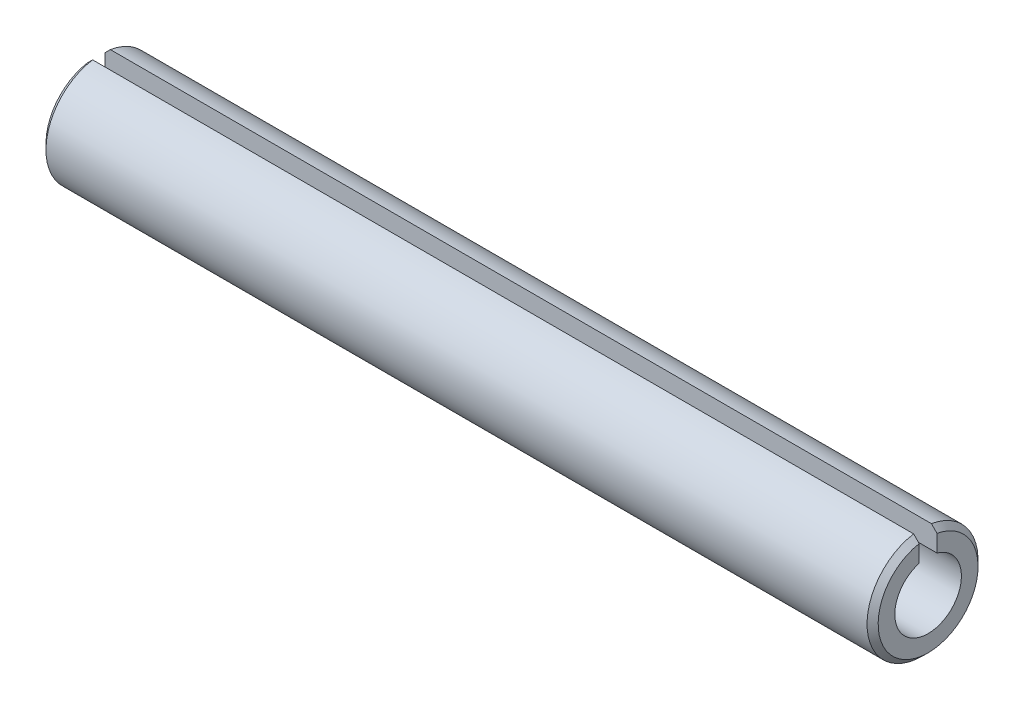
ISO-10303-21;
HEADER;
FILE_DESCRIPTION(('STEP AP214'),'2;1');
FILE_NAME('part.step','',(''),(''),'','','');
FILE_SCHEMA(('AUTOMOTIVE_DESIGN { 1 0 10303 214 1 1 1 1 }'));
ENDSEC;
DATA;
#1=APPLICATION_CONTEXT('core data for automotive mechanical design processes');
#2=APPLICATION_PROTOCOL_DEFINITION('international standard','automotive_design',2000,#1);
#3=PRODUCT_CONTEXT('',#1,'mechanical');
#4=PRODUCT('Part','Part','',(#3));
#5=PRODUCT_RELATED_PRODUCT_CATEGORY('part','',(#4));
#6=PRODUCT_DEFINITION_FORMATION('','',#4);
#7=PRODUCT_DEFINITION_CONTEXT('part definition',#1,'design');
#8=PRODUCT_DEFINITION('design','',#6,#7);
#9=PRODUCT_DEFINITION_SHAPE('','',#8);
#10=(LENGTH_UNIT() NAMED_UNIT(*) SI_UNIT(.MILLI.,.METRE.));
#11=(NAMED_UNIT(*) PLANE_ANGLE_UNIT() SI_UNIT($,.RADIAN.));
#12=(NAMED_UNIT(*) SI_UNIT($,.STERADIAN.) SOLID_ANGLE_UNIT());
#13=UNCERTAINTY_MEASURE_WITH_UNIT(LENGTH_MEASURE(1.E-05),#10,'distance_accuracy_value','');
#14=(GEOMETRIC_REPRESENTATION_CONTEXT(3) GLOBAL_UNCERTAINTY_ASSIGNED_CONTEXT((#13)) GLOBAL_UNIT_ASSIGNED_CONTEXT((#10,
#11,#12)) REPRESENTATION_CONTEXT('',''));
#15=CARTESIAN_POINT('',(0.,0.,0.));
#16=DIRECTION('',(0.,0.,1.));
#17=DIRECTION('',(1.,0.,0.));
#18=AXIS2_PLACEMENT_3D('',#15,#16,#17);
#19=CARTESIAN_POINT('',(0.,0.,0.));
#20=DIRECTION('',(-1.,0.,0.));
#21=DIRECTION('',(0.,0.,1.));
#22=AXIS2_PLACEMENT_3D('',#19,#20,#21);
#23=CYLINDRICAL_SURFACE('',#22,1.2);
#24=DIRECTION('',(-1.,0.,0.));
#25=VECTOR('',#24,1.);
#26=CARTESIAN_POINT('',(30.,1.15654658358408,0.32));
#27=LINE('',#26,#25);
#28=CARTESIAN_POINT('',(30.,1.15654658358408,0.32));
#29=VERTEX_POINT('',#28);
#30=CARTESIAN_POINT('',(0.,1.15654658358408,0.320000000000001));
#31=VERTEX_POINT('',#30);
#32=EDGE_CURVE('E47',#29,#31,#27,.T.);
#33=ORIENTED_EDGE('',*,*,#32,.F.);
#34=CARTESIAN_POINT('',(30.,0.,0.));
#35=DIRECTION('',(-1.,0.,0.));
#36=DIRECTION('',(0.,0.,1.));
#37=AXIS2_PLACEMENT_3D('',#34,#35,#36);
#38=CIRCLE('',#37,1.2);
#39=CARTESIAN_POINT('',(30.,1.15654658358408,-0.32));
#40=VERTEX_POINT('',#39);
#41=EDGE_CURVE('E89',#40,#29,#38,.T.);
#42=ORIENTED_EDGE('',*,*,#41,.F.);
#43=DIRECTION('',(-1.,0.,0.));
#44=VECTOR('',#43,1.);
#45=CARTESIAN_POINT('',(30.,1.15654658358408,-0.32));
#46=LINE('',#45,#44);
#47=CARTESIAN_POINT('',(0.,1.15654658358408,-0.32));
#48=VERTEX_POINT('',#47);
#49=EDGE_CURVE('E83',#40,#48,#46,.T.);
#50=ORIENTED_EDGE('',*,*,#49,.T.);
#51=CARTESIAN_POINT('',(0.,0.,0.));
#52=DIRECTION('',(-1.,0.,0.));
#53=DIRECTION('',(0.,0.,1.));
#54=AXIS2_PLACEMENT_3D('',#51,#52,#53);
#55=CIRCLE('',#54,1.2);
#56=EDGE_CURVE('E93',#48,#31,#55,.T.);
#57=ORIENTED_EDGE('',*,*,#56,.T.);
#58=EDGE_LOOP('',(#33,#42,#50,#57));
#59=FACE_BOUND('',#58,.T.);
#60=ADVANCED_FACE('F33',(#59),#23,.F.);
#61=CARTESIAN_POINT('',(30.,1.2,0.));
#62=DIRECTION('',(-1.,0.,0.));
#63=DIRECTION('',(0.,0.,1.));
#64=AXIS2_PLACEMENT_3D('',#61,#62,#63);
#65=PLANE('',#64);
#66=DIRECTION('',(0.,-1.,0.));
#67=VECTOR('',#66,1.);
#68=CARTESIAN_POINT('',(30.,1.97423402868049,0.32));
#69=LINE('',#68,#67);
#70=CARTESIAN_POINT('',(30.,1.77132718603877,0.32));
#71=VERTEX_POINT('',#70);
#72=EDGE_CURVE('E124',#71,#29,#69,.T.);
#73=ORIENTED_EDGE('',*,*,#72,.F.);
#74=CARTESIAN_POINT('',(30.,0.,0.));
#75=DIRECTION('',(-1.,0.,0.));
#76=DIRECTION('',(0.,0.,1.));
#77=AXIS2_PLACEMENT_3D('',#74,#75,#76);
#78=CIRCLE('',#77,1.8);
#79=CARTESIAN_POINT('',(30.,1.77132718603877,-0.32));
#80=VERTEX_POINT('',#79);
#81=EDGE_CURVE('E117',#80,#71,#78,.T.);
#82=ORIENTED_EDGE('',*,*,#81,.F.);
#83=DIRECTION('',(0.,-1.,0.));
#84=VECTOR('',#83,1.);
#85=CARTESIAN_POINT('',(30.,1.97423402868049,-0.32));
#86=LINE('',#85,#84);
#87=EDGE_CURVE('E125',#80,#40,#86,.T.);
#88=ORIENTED_EDGE('',*,*,#87,.T.);
#89=ORIENTED_EDGE('',*,*,#41,.T.);
#90=EDGE_LOOP('',(#73,#82,#88,#89));
#91=FACE_BOUND('',#90,.T.);
#92=ADVANCED_FACE('F122',(#91),#65,.F.);
#93=CARTESIAN_POINT('',(0.,0.,0.));
#94=DIRECTION('',(-1.,0.,0.));
#95=DIRECTION('',(0.,0.,1.));
#96=AXIS2_PLACEMENT_3D('',#93,#94,#95);
#97=CYLINDRICAL_SURFACE('',#96,2.);
#98=DIRECTION('',(-1.,0.,0.));
#99=VECTOR('',#98,1.);
#100=CARTESIAN_POINT('',(30.,1.97423402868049,0.32));
#101=LINE('',#100,#99);
#102=CARTESIAN_POINT('',(29.8,1.97423402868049,0.32));
#103=VERTEX_POINT('',#102);
#104=CARTESIAN_POINT('',(0.199999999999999,1.97423402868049,0.32));
#105=VERTEX_POINT('',#104);
#106=EDGE_CURVE('E132',#103,#105,#101,.T.);
#107=ORIENTED_EDGE('',*,*,#106,.T.);
#108=CARTESIAN_POINT('',(0.199999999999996,0.,0.));
#109=DIRECTION('',(-1.,0.,0.));
#110=DIRECTION('',(0.,0.,1.));
#111=AXIS2_PLACEMENT_3D('',#108,#109,#110);
#112=CIRCLE('',#111,2.);
#113=CARTESIAN_POINT('',(0.199999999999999,1.97423402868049,-0.32));
#114=VERTEX_POINT('',#113);
#115=EDGE_CURVE('E101',#114,#105,#112,.T.);
#116=ORIENTED_EDGE('',*,*,#115,.F.);
#117=DIRECTION('',(-1.,0.,0.));
#118=VECTOR('',#117,1.);
#119=CARTESIAN_POINT('',(30.,1.97423402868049,-0.32));
#120=LINE('',#119,#118);
#121=CARTESIAN_POINT('',(29.8,1.97423402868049,-0.32));
#122=VERTEX_POINT('',#121);
#123=EDGE_CURVE('E95',#122,#114,#120,.T.);
#124=ORIENTED_EDGE('',*,*,#123,.F.);
#125=CARTESIAN_POINT('',(29.8,0.,0.));
#126=DIRECTION('',(-1.,0.,0.));
#127=DIRECTION('',(0.,0.,1.));
#128=AXIS2_PLACEMENT_3D('',#125,#126,#127);
#129=CIRCLE('',#128,2.);
#130=EDGE_CURVE('E114',#122,#103,#129,.T.);
#131=ORIENTED_EDGE('',*,*,#130,.T.);
#132=EDGE_LOOP('',(#107,#116,#124,#131));
#133=FACE_BOUND('',#132,.T.);
#134=ADVANCED_FACE('F167',(#133),#97,.T.);
#135=CARTESIAN_POINT('',(0.199999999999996,0.,0.));
#136=DIRECTION('',(1.,0.,0.));
#137=DIRECTION('',(0.,0.,-1.));
#138=AXIS2_PLACEMENT_3D('',#135,#136,#137);
#139=CONICAL_SURFACE('',#138,2.,0.785398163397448);
#140=CARTESIAN_POINT('',(-1.00420370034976,0.728623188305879,0.32));
#141=CARTESIAN_POINT('',(-0.977957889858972,0.757281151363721,0.32));
#142=CARTESIAN_POINT('',(-0.951584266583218,0.785821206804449,0.32));
#143=CARTESIAN_POINT('',(-0.898636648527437,0.842713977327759,0.32));
#144=CARTESIAN_POINT('',(-0.872062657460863,0.871066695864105,0.32));
#145=CARTESIAN_POINT('',(-0.792123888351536,0.955915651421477,0.32));
#146=CARTESIAN_POINT('',(-0.738539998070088,1.01220519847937,0.32));
#147=CARTESIAN_POINT('',(-0.631021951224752,1.12444027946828,0.32));
#148=CARTESIAN_POINT('',(-0.577087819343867,1.18038583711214,0.32));
#149=CARTESIAN_POINT('',(-0.468984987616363,1.2920510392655,0.32));
#150=CARTESIAN_POINT('',(-0.41481628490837,1.34777068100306,0.32));
#151=CARTESIAN_POINT('',(-0.284121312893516,1.48182109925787,0.32));
#152=CARTESIAN_POINT('',(-0.207516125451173,1.56007487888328,0.32));
#153=CARTESIAN_POINT('',(-0.0541018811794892,1.71638576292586,0.32));
#154=CARTESIAN_POINT('',(0.0227071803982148,1.79444286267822,0.32));
#155=CARTESIAN_POINT('',(0.285552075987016,2.06110704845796,0.32));
#156=CARTESIAN_POINT('',(0.471907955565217,2.24939855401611,0.32));
#157=CARTESIAN_POINT('',(0.751692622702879,2.53157443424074,0.32));
#158=CARTESIAN_POINT('',(0.844992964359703,2.62558646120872,0.32));
#159=CARTESIAN_POINT('',(1.03166078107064,2.81354363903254,0.32));
#160=CARTESIAN_POINT('',(1.12502825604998,2.90748878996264,0.32));
#161=CARTESIAN_POINT('',(1.21842016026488,3.00140971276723,0.32));
#162=B_SPLINE_CURVE_WITH_KNOTS('',3,(#140,#141,#142,#143,#144,#145,#146,#147,#148,#149,#150,
#151,#152,#153,#154,#155,#156,#157,#158,#159,#160,#161),.UNSPECIFIED.,.F.,.F.,(4,2,2,2,2,2,2,2,
2,2,4),(0.,0.116579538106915,0.233156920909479,0.466301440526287,0.699429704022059,
0.932560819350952,1.26108429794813,1.58961549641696,2.38437177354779,2.7817242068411,
3.17907619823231),.UNSPECIFIED.);
#163=CARTESIAN_POINT('',(0.,1.77132718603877,0.32));
#164=VERTEX_POINT('',#163);
#165=EDGE_CURVE('E103',#164,#105,#162,.T.);
#166=ORIENTED_EDGE('',*,*,#165,.F.);
#167=CARTESIAN_POINT('',(0.,0.,0.));
#168=DIRECTION('',(-1.,0.,0.));
#169=DIRECTION('',(0.,0.,1.));
#170=AXIS2_PLACEMENT_3D('',#167,#168,#169);
#171=CIRCLE('',#170,1.8);
#172=CARTESIAN_POINT('',(0.,1.77132718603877,-0.32));
#173=VERTEX_POINT('',#172);
#174=EDGE_CURVE('E98',#173,#164,#171,.T.);
#175=ORIENTED_EDGE('',*,*,#174,.F.);
#176=CARTESIAN_POINT('',(-1.00420370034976,0.728623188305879,-0.32));
#177=CARTESIAN_POINT('',(-0.977957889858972,0.757281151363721,-0.32));
#178=CARTESIAN_POINT('',(-0.951584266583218,0.785821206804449,-0.32));
#179=CARTESIAN_POINT('',(-0.898636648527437,0.842713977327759,-0.32));
#180=CARTESIAN_POINT('',(-0.872062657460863,0.871066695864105,-0.32));
#181=CARTESIAN_POINT('',(-0.792123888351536,0.955915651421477,-0.32));
#182=CARTESIAN_POINT('',(-0.738539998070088,1.01220519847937,-0.32));
#183=CARTESIAN_POINT('',(-0.631021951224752,1.12444027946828,-0.32));
#184=CARTESIAN_POINT('',(-0.577087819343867,1.18038583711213,-0.32));
#185=CARTESIAN_POINT('',(-0.468984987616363,1.29205103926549,-0.32));
#186=CARTESIAN_POINT('',(-0.41481628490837,1.34777068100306,-0.32));
#187=CARTESIAN_POINT('',(-0.284121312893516,1.48182109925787,-0.32));
#188=CARTESIAN_POINT('',(-0.207516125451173,1.56007487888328,-0.32));
#189=CARTESIAN_POINT('',(-0.0541018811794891,1.71638576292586,-0.32));
#190=CARTESIAN_POINT('',(0.0227071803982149,1.79444286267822,-0.32));
#191=CARTESIAN_POINT('',(0.285552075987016,2.06110704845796,-0.32));
#192=CARTESIAN_POINT('',(0.471907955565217,2.24939855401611,-0.32));
#193=CARTESIAN_POINT('',(0.751692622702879,2.53157443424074,-0.32));
#194=CARTESIAN_POINT('',(0.844992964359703,2.62558646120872,-0.32));
#195=CARTESIAN_POINT('',(1.03166078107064,2.81354363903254,-0.32));
#196=CARTESIAN_POINT('',(1.12502825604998,2.90748878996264,-0.32));
#197=CARTESIAN_POINT('',(1.21842016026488,3.00140971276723,-0.32));
#198=B_SPLINE_CURVE_WITH_KNOTS('',3,(#176,#177,#178,#179,#180,#181,#182,#183,#184,#185,#186,
#187,#188,#189,#190,#191,#192,#193,#194,#195,#196,#197),.UNSPECIFIED.,.F.,.F.,(4,2,2,2,2,2,2,2,
2,2,4),(0.,0.116579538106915,0.233156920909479,0.466301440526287,0.699429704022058,
0.932560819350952,1.26108429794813,1.58961549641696,2.38437177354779,2.7817242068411,
3.17907619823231),.UNSPECIFIED.);
#199=EDGE_CURVE('E54',#173,#114,#198,.T.);
#200=ORIENTED_EDGE('',*,*,#199,.T.);
#201=ORIENTED_EDGE('',*,*,#115,.T.);
#202=EDGE_LOOP('',(#166,#175,#200,#201));
#203=FACE_BOUND('',#202,.T.);
#204=ADVANCED_FACE('F145',(#203),#139,.T.);
#205=CARTESIAN_POINT('',(0.,1.2,0.));
#206=DIRECTION('',(-1.,0.,0.));
#207=DIRECTION('',(0.,0.,1.));
#208=AXIS2_PLACEMENT_3D('',#205,#206,#207);
#209=PLANE('',#208);
#210=ORIENTED_EDGE('',*,*,#174,.T.);
#211=DIRECTION('',(0.,-1.,0.));
#212=VECTOR('',#211,1.);
#213=CARTESIAN_POINT('',(0.,1.2,0.32));
#214=LINE('',#213,#212);
#215=EDGE_CURVE('E11',#164,#31,#214,.T.);
#216=ORIENTED_EDGE('',*,*,#215,.T.);
#217=ORIENTED_EDGE('',*,*,#56,.F.);
#218=DIRECTION('',(0.,-1.,0.));
#219=VECTOR('',#218,1.);
#220=CARTESIAN_POINT('',(0.,1.2,-0.32));
#221=LINE('',#220,#219);
#222=EDGE_CURVE('E40',#173,#48,#221,.T.);
#223=ORIENTED_EDGE('',*,*,#222,.F.);
#224=EDGE_LOOP('',(#210,#216,#217,#223));
#225=FACE_BOUND('',#224,.T.);
#226=ADVANCED_FACE('F97',(#225),#209,.T.);
#227=CARTESIAN_POINT('',(30.,0.,0.));
#228=DIRECTION('',(-1.,0.,0.));
#229=DIRECTION('',(0.,0.,1.));
#230=AXIS2_PLACEMENT_3D('',#227,#228,#229);
#231=CONICAL_SURFACE('',#230,1.8,0.785398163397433);
#232=ORIENTED_EDGE('',*,*,#130,.F.);
#233=CARTESIAN_POINT('',(28.7815798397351,3.00140971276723,-0.32));
#234=CARTESIAN_POINT('',(28.8749756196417,2.9074815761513,-0.32));
#235=CARTESIAN_POINT('',(28.9683495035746,2.81353163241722,-0.32));
#236=CARTESIAN_POINT('',(29.1550293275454,2.62556566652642,-0.32));
#237=CARTESIAN_POINT('',(29.2483352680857,2.53154964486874,-0.32));
#238=CARTESIAN_POINT('',(29.4348522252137,2.3434319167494,-0.32));
#239=CARTESIAN_POINT('',(29.5280632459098,2.24933021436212,-0.32));
#240=CARTESIAN_POINT('',(29.7143551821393,2.06099658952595,-0.32));
#241=CARTESIAN_POINT('',(29.8074360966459,1.9667646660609,-0.32));
#242=CARTESIAN_POINT('',(29.9934064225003,1.77809815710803,-0.32));
#243=CARTESIAN_POINT('',(30.0862958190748,1.68366355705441,-0.32));
#244=CARTESIAN_POINT('',(30.2717560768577,1.49448488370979,-0.32));
#245=CARTESIAN_POINT('',(30.3643269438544,1.39974081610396,-0.32));
#246=CARTESIAN_POINT('',(30.5027579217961,1.25720439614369,-0.32));
#247=CARTESIAN_POINT('',(30.5488324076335,1.20962041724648,-0.32));
#248=CARTESIAN_POINT('',(30.6407747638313,1.11425427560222,-0.32));
#249=CARTESIAN_POINT('',(30.6866426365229,1.066472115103,-0.32));
#250=CARTESIAN_POINT('',(30.7780899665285,0.970625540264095,-0.32));
#251=CARTESIAN_POINT('',(30.8236694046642,0.922561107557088,-0.32));
#252=CARTESIAN_POINT('',(30.914346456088,0.82597683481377,-0.32));
#253=CARTESIAN_POINT('',(30.9594440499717,0.777456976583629,-0.32));
#254=CARTESIAN_POINT('',(31.0042037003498,0.728623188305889,-0.32));
#255=B_SPLINE_CURVE_WITH_KNOTS('',3,(#233,#234,#235,#236,#237,#238,#239,#240,#241,#242,#243,
#244,#245,#246,#247,#248,#249,#250,#251,#252,#253,#254),.UNSPECIFIED.,.F.,.F.,(4,2,2,2,2,2,2,2,
2,2,4),(0.,0.39737567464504,0.794748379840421,1.19210308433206,1.58946090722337,
1.98684831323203,2.38422845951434,2.58293338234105,2.78163605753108,2.98035180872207,
3.17907553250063),.UNSPECIFIED.);
#256=EDGE_CURVE('E141',#122,#80,#255,.T.);
#257=ORIENTED_EDGE('',*,*,#256,.T.);
#258=ORIENTED_EDGE('',*,*,#81,.T.);
#259=CARTESIAN_POINT('',(28.7815798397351,3.00140971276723,0.32));
#260=CARTESIAN_POINT('',(28.8749756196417,2.9074815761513,0.32));
#261=CARTESIAN_POINT('',(28.9683495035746,2.81353163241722,0.32));
#262=CARTESIAN_POINT('',(29.1550293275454,2.62556566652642,0.32));
#263=CARTESIAN_POINT('',(29.2483352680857,2.53154964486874,0.32));
#264=CARTESIAN_POINT('',(29.4348522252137,2.3434319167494,0.32));
#265=CARTESIAN_POINT('',(29.5280632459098,2.24933021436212,0.32));
#266=CARTESIAN_POINT('',(29.7143551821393,2.06099658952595,0.32));
#267=CARTESIAN_POINT('',(29.8074360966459,1.9667646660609,0.32));
#268=CARTESIAN_POINT('',(29.9934064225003,1.77809815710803,0.32));
#269=CARTESIAN_POINT('',(30.0862958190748,1.68366355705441,0.32));
#270=CARTESIAN_POINT('',(30.2717560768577,1.49448488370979,0.32));
#271=CARTESIAN_POINT('',(30.3643269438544,1.39974081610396,0.32));
#272=CARTESIAN_POINT('',(30.5027579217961,1.25720439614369,0.32));
#273=CARTESIAN_POINT('',(30.5488324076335,1.20962041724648,0.32));
#274=CARTESIAN_POINT('',(30.6407747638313,1.11425427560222,0.32));
#275=CARTESIAN_POINT('',(30.6866426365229,1.066472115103,0.32));
#276=CARTESIAN_POINT('',(30.7780899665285,0.970625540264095,0.32));
#277=CARTESIAN_POINT('',(30.8236694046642,0.922561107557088,0.32));
#278=CARTESIAN_POINT('',(30.914346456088,0.82597683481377,0.32));
#279=CARTESIAN_POINT('',(30.9594440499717,0.777456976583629,0.32));
#280=CARTESIAN_POINT('',(31.0042037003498,0.728623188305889,0.32));
#281=B_SPLINE_CURVE_WITH_KNOTS('',3,(#259,#260,#261,#262,#263,#264,#265,#266,#267,#268,#269,
#270,#271,#272,#273,#274,#275,#276,#277,#278,#279,#280),.UNSPECIFIED.,.F.,.F.,(4,2,2,2,2,2,2,2,
2,2,4),(0.,0.39737567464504,0.794748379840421,1.19210308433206,1.58946090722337,
1.98684831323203,2.38422845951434,2.58293338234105,2.78163605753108,2.98035180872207,
3.17907553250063),.UNSPECIFIED.);
#282=EDGE_CURVE('E99',#103,#71,#281,.T.);
#283=ORIENTED_EDGE('',*,*,#282,.F.);
#284=EDGE_LOOP('',(#232,#257,#258,#283));
#285=FACE_BOUND('',#284,.T.);
#286=ADVANCED_FACE('F152',(#285),#231,.T.);
#287=CARTESIAN_POINT('',(30.,1.97423402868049,-0.32));
#288=DIRECTION('',(0.,0.,-1.));
#289=DIRECTION('',(0.,1.,0.));
#290=AXIS2_PLACEMENT_3D('',#287,#288,#289);
#291=PLANE('',#290);
#292=ORIENTED_EDGE('',*,*,#123,.T.);
#293=ORIENTED_EDGE('',*,*,#199,.F.);
#294=ORIENTED_EDGE('',*,*,#222,.T.);
#295=ORIENTED_EDGE('',*,*,#49,.F.);
#296=ORIENTED_EDGE('',*,*,#87,.F.);
#297=ORIENTED_EDGE('',*,*,#256,.F.);
#298=EDGE_LOOP('',(#292,#293,#294,#295,#296,#297));
#299=FACE_BOUND('',#298,.T.);
#300=ADVANCED_FACE('F82',(#299),#291,.F.);
#301=CARTESIAN_POINT('',(30.,1.97423402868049,0.32));
#302=DIRECTION('',(0.,0.,-1.));
#303=DIRECTION('',(0.,1.,0.));
#304=AXIS2_PLACEMENT_3D('',#301,#302,#303);
#305=PLANE('',#304);
#306=ORIENTED_EDGE('',*,*,#282,.T.);
#307=ORIENTED_EDGE('',*,*,#72,.T.);
#308=ORIENTED_EDGE('',*,*,#32,.T.);
#309=ORIENTED_EDGE('',*,*,#215,.F.);
#310=ORIENTED_EDGE('',*,*,#165,.T.);
#311=ORIENTED_EDGE('',*,*,#106,.F.);
#312=EDGE_LOOP('',(#306,#307,#308,#309,#310,#311));
#313=FACE_BOUND('',#312,.T.);
#314=ADVANCED_FACE('F151',(#313),#305,.T.);
#315=CLOSED_SHELL('',(#60,#92,#134,#204,#226,#286,#300,#314));
#316=MANIFOLD_SOLID_BREP('B2',#315);
#317=ADVANCED_BREP_SHAPE_REPRESENTATION('',(#18,#316),#14);
#318=SHAPE_DEFINITION_REPRESENTATION(#9,#317);
ENDSEC;
END-ISO-10303-21;
